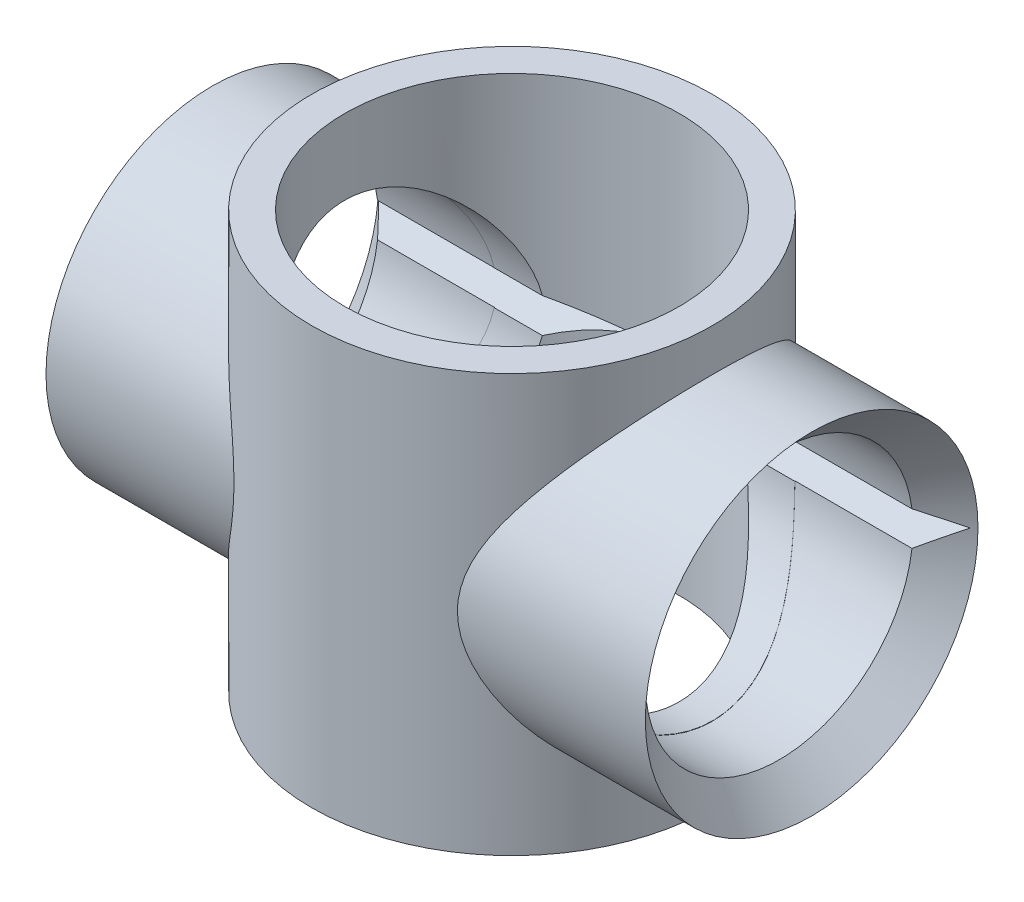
from build123d import *

# Parameters (mm, degrees)
SKETCH1_R           = 19.05
SKETCH1_R_2         = 15.9004
BOSS_EXTRUDE1_DEPTH = 19.84375
SKETCH3_R           = 15.8115
SKETCH3_R_2         = 12.7254
BOSS_EXTRUDE2_DEPTH = 25.4
SKETCH5_R           = 15.9004
CUT_EXTRUDE2_DEPTH  = 51.8247988
CUT_EXTRUDE3_DEPTH  = 50.8
CUT_EXTRUDE4_DEPTH  = 40.599682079


with BuildPart() as part:
    # Sketch1 → Boss-Extrude1 (new, symmetric)
    with BuildSketch(Plane(origin=(0, 0, 0), x_dir=(1, 0, 0), z_dir=(0, 1, 0))):
        with Locations(Location((0, 0, 0), (0, 0, 90))):
            Circle(SKETCH1_R)
        with Locations(Location((0, 0, 0), (0, 0, 90))):
            Circle(SKETCH1_R_2, mode=Mode.SUBTRACT)
    extrude(amount=BOSS_EXTRUDE1_DEPTH, both=True)

    # Sketch3 → Boss-Extrude2 (add, symmetric)
    with BuildSketch(Plane(origin=(0, 0, 0), x_dir=(0, 0, -1), z_dir=(1, 0, 0))):
        with Locations(Location((0, 0, 0), (0, 0, 180))):
            Circle(SKETCH3_R)
        with Locations(Location((0, 0, 0), (0, 0, 180))):
            Circle(SKETCH3_R_2, mode=Mode.SUBTRACT)
    extrude(amount=BOSS_EXTRUDE2_DEPTH, both=True)

    # Sketch5 → Cut-Extrude2 (cut, through all)
    with BuildSketch(Plane(origin=(0, 19.84375, 0), x_dir=(1, 0, 0), z_dir=(0, 1, 0))):
        with Locations(Location((0, 0, 0), (0, 0, 90))):
            Circle(SKETCH5_R)
    extrude(amount=-CUT_EXTRUDE2_DEPTH, mode=Mode.SUBTRACT)

    # Sketch6 → Cut-Extrude3 (cut)
    with BuildSketch(Plane(origin=(25.4, 0, 0), x_dir=(0, 0, -1), z_dir=(1, 0, 0))):
        with BuildLine():
            Line((-15.24, 0), (-12.608818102, 1.519113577))
            ThreePointArc((-12.608818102, 1.519113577), (0, 12.7), (12.608818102, 1.519113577))
            Line((12.608818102, 1.519113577), (15.24, 0))
            Line((15.24, 0), (12.608818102, -1.519113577))
            ThreePointArc((12.608818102, -1.519113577), (0, -12.7), (-12.608818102, -1.519113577))
            Line((-12.608818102, -1.519113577), (-15.24, 0))
        make_face()
    extrude(amount=-CUT_EXTRUDE3_DEPTH, mode=Mode.SUBTRACT)

    # Sketch8 → Revolve3 (revolve)
    with BuildSketch(Plane.XY, mode=Mode.PRIVATE) as revolve3_sk:
        Polygon((-25.4, 15.8115), (-28.4861, 15.8115), (-25.4, 12.7254), align=None)
        Polygon((25.4, 15.8115), (28.4861, 15.8115), (25.4, 12.7254), align=None)
    revolve(revolve3_sk.sketch.rotate(Axis((25.4, 0, 0), (-1, 0, 0)), 270), axis=Axis((25.4, 0, 0), (-1, 0, 0)))

    # Sketch9 → Cut-Extrude4 (cut, symmetric)
    with BuildSketch(Plane(origin=(0, 0, 0), x_dir=(0, 0, -1), z_dir=(1, 0, 0))):
        Polygon((-12.536298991, 1.676452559), (-15.44, 0), (-12.536298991, -1.676452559), align=None)
    cut_extrude4 = extrude(amount=CUT_EXTRUDE4_DEPTH, both=True, mode=Mode.SUBTRACT)

    # Mirror1: Cut-Extrude4 across plane
    add(cut_extrude4.mirror(Plane.XY), mode=Mode.SUBTRACT)


solid = part.part
